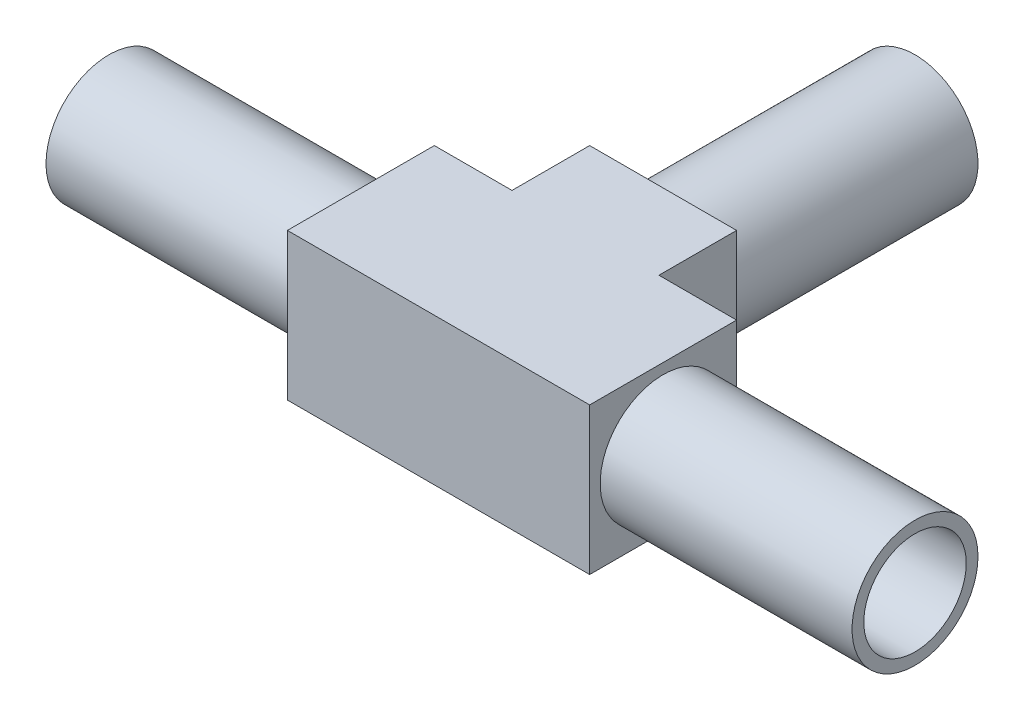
ISO-10303-21;
HEADER;
FILE_DESCRIPTION(('STEP AP214'),'2;1');
FILE_NAME('part.step','',(''),(''),'','','');
FILE_SCHEMA(('AUTOMOTIVE_DESIGN { 1 0 10303 214 1 1 1 1 }'));
ENDSEC;
DATA;
#1=APPLICATION_CONTEXT('core data for automotive mechanical design processes');
#2=APPLICATION_PROTOCOL_DEFINITION('international standard','automotive_design',2000,#1);
#3=PRODUCT_CONTEXT('',#1,'mechanical');
#4=PRODUCT('Part','Part','',(#3));
#5=PRODUCT_RELATED_PRODUCT_CATEGORY('part','',(#4));
#6=PRODUCT_DEFINITION_FORMATION('','',#4);
#7=PRODUCT_DEFINITION_CONTEXT('part definition',#1,'design');
#8=PRODUCT_DEFINITION('design','',#6,#7);
#9=PRODUCT_DEFINITION_SHAPE('','',#8);
#10=(LENGTH_UNIT() NAMED_UNIT(*) SI_UNIT(.MILLI.,.METRE.));
#11=(NAMED_UNIT(*) PLANE_ANGLE_UNIT() SI_UNIT($,.RADIAN.));
#12=(NAMED_UNIT(*) SI_UNIT($,.STERADIAN.) SOLID_ANGLE_UNIT());
#13=UNCERTAINTY_MEASURE_WITH_UNIT(LENGTH_MEASURE(1.E-05),#10,'distance_accuracy_value','');
#14=(GEOMETRIC_REPRESENTATION_CONTEXT(3) GLOBAL_UNCERTAINTY_ASSIGNED_CONTEXT((#13)) GLOBAL_UNIT_ASSIGNED_CONTEXT((#10,
#11,#12)) REPRESENTATION_CONTEXT('',''));
#15=CARTESIAN_POINT('',(0.,0.,0.));
#16=DIRECTION('',(0.,0.,1.));
#17=DIRECTION('',(1.,0.,0.));
#18=AXIS2_PLACEMENT_3D('',#15,#16,#17);
#19=CARTESIAN_POINT('',(24.92375,5.55625,0.));
#20=DIRECTION('',(-1.,0.,0.));
#21=DIRECTION('',(0.,0.,1.));
#22=AXIS2_PLACEMENT_3D('',#19,#20,#21);
#23=PLANE('',#22);
#24=DIRECTION('',(0.,1.,0.));
#25=VECTOR('',#24,1.);
#26=CARTESIAN_POINT('',(24.92375,5.55625,-5.55625));
#27=LINE('',#26,#25);
#28=CARTESIAN_POINT('',(24.92375,5.55625,-5.55625));
#29=VERTEX_POINT('',#28);
#30=CARTESIAN_POINT('',(24.92375,-5.55625000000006,-5.55625000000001));
#31=VERTEX_POINT('',#30);
#32=EDGE_CURVE('E154',#29,#31,#27,.F.);
#33=ORIENTED_EDGE('',*,*,#32,.F.);
#34=DIRECTION('',(0.,0.,1.));
#35=VECTOR('',#34,1.);
#36=CARTESIAN_POINT('',(24.92375,5.55625,5.55625));
#37=LINE('',#36,#35);
#38=CARTESIAN_POINT('',(24.92375,5.55625,-11.43));
#39=VERTEX_POINT('',#38);
#40=EDGE_CURVE('E144',#39,#29,#37,.T.);
#41=ORIENTED_EDGE('',*,*,#40,.F.);
#42=DIRECTION('',(0.,1.,0.));
#43=VECTOR('',#42,1.);
#44=CARTESIAN_POINT('',(24.92375,0.,-11.43));
#45=LINE('',#44,#43);
#46=CARTESIAN_POINT('',(24.92375,-5.55625000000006,-11.43));
#47=VERTEX_POINT('',#46);
#48=EDGE_CURVE('E158',#47,#39,#45,.T.);
#49=ORIENTED_EDGE('',*,*,#48,.F.);
#50=DIRECTION('',(0.,0.,1.));
#51=VECTOR('',#50,1.);
#52=CARTESIAN_POINT('',(24.92375,-5.55625000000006,-5.55625000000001));
#53=LINE('',#52,#51);
#54=EDGE_CURVE('E140',#31,#47,#53,.F.);
#55=ORIENTED_EDGE('',*,*,#54,.F.);
#56=EDGE_LOOP('',(#33,#41,#49,#55));
#57=FACE_BOUND('',#56,.T.);
#58=ADVANCED_FACE('F16',(#57),#23,.T.);
#59=CARTESIAN_POINT('',(36.03625,-5.55625,0.));
#60=DIRECTION('',(1.,0.,0.));
#61=DIRECTION('',(0.,0.,-1.));
#62=AXIS2_PLACEMENT_3D('',#59,#60,#61);
#63=PLANE('',#62);
#64=DIRECTION('',(0.,1.,0.));
#65=VECTOR('',#64,1.);
#66=CARTESIAN_POINT('',(36.03625,0.,-11.43));
#67=LINE('',#66,#65);
#68=CARTESIAN_POINT('',(36.03625,5.55625,-11.43));
#69=VERTEX_POINT('',#68);
#70=CARTESIAN_POINT('',(36.03625,-5.55625000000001,-11.43));
#71=VERTEX_POINT('',#70);
#72=EDGE_CURVE('E156',#69,#71,#67,.F.);
#73=ORIENTED_EDGE('',*,*,#72,.F.);
#74=DIRECTION('',(0.,0.,1.));
#75=VECTOR('',#74,1.);
#76=CARTESIAN_POINT('',(36.03625,5.55625,5.55625000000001));
#77=LINE('',#76,#75);
#78=CARTESIAN_POINT('',(36.03625,5.55625,-5.55624999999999));
#79=VERTEX_POINT('',#78);
#80=EDGE_CURVE('E150',#79,#69,#77,.F.);
#81=ORIENTED_EDGE('',*,*,#80,.F.);
#82=DIRECTION('',(0.,1.,0.));
#83=VECTOR('',#82,1.);
#84=CARTESIAN_POINT('',(36.03625,5.55625,-5.55624999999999));
#85=LINE('',#84,#83);
#86=CARTESIAN_POINT('',(36.03625,-5.55625000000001,-5.55625));
#87=VERTEX_POINT('',#86);
#88=EDGE_CURVE('E130',#87,#79,#85,.T.);
#89=ORIENTED_EDGE('',*,*,#88,.F.);
#90=DIRECTION('',(0.,0.,1.));
#91=VECTOR('',#90,1.);
#92=CARTESIAN_POINT('',(36.03625,-5.55625000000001,-5.55625));
#93=LINE('',#92,#91);
#94=EDGE_CURVE('E102',#71,#87,#93,.T.);
#95=ORIENTED_EDGE('',*,*,#94,.F.);
#96=EDGE_LOOP('',(#73,#81,#89,#95));
#97=FACE_BOUND('',#96,.T.);
#98=ADVANCED_FACE('F239',(#97),#63,.T.);
#99=CARTESIAN_POINT('',(33.258125,0.,-11.43));
#100=DIRECTION('',(0.,0.,-1.));
#101=DIRECTION('',(-1.,0.,0.));
#102=AXIS2_PLACEMENT_3D('',#99,#100,#101);
#103=PLANE('',#102);
#104=DIRECTION('',(1.,0.,0.));
#105=VECTOR('',#104,1.);
#106=CARTESIAN_POINT('',(19.05,5.55625,-11.43));
#107=LINE('',#106,#105);
#108=EDGE_CURVE('E147',#69,#39,#107,.F.);
#109=ORIENTED_EDGE('',*,*,#108,.F.);
#110=ORIENTED_EDGE('',*,*,#72,.T.);
#111=DIRECTION('',(1.,0.,0.));
#112=VECTOR('',#111,1.);
#113=CARTESIAN_POINT('',(19.05,-5.55625000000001,-11.43));
#114=LINE('',#113,#112);
#115=EDGE_CURVE('E138',#47,#71,#114,.T.);
#116=ORIENTED_EDGE('',*,*,#115,.F.);
#117=ORIENTED_EDGE('',*,*,#48,.T.);
#118=EDGE_LOOP('',(#109,#110,#116,#117));
#119=FACE_BOUND('',#118,.T.);
#120=CARTESIAN_POINT('',(30.48,0.,-11.43));
#121=DIRECTION('',(0.,0.,-1.));
#122=DIRECTION('',(-1.,0.,0.));
#123=AXIS2_PLACEMENT_3D('',#120,#121,#122);
#124=CIRCLE('',#123,4.7625);
#125=CARTESIAN_POINT('',(25.7175,0.,-11.43));
#126=VERTEX_POINT('',#125);
#127=EDGE_CURVE('E19',#126,#126,#124,.T.);
#128=ORIENTED_EDGE('',*,*,#127,.F.);
#129=EDGE_LOOP('',(#128));
#130=FACE_BOUND('',#129,.T.);
#131=ADVANCED_FACE('F236',(#119,#130),#103,.T.);
#132=CARTESIAN_POINT('',(19.05,5.55625,-5.55625));
#133=DIRECTION('',(0.,0.,-1.));
#134=DIRECTION('',(-1.,0.,0.));
#135=AXIS2_PLACEMENT_3D('',#132,#133,#134);
#136=PLANE('',#135);
#137=DIRECTION('',(0.,1.,0.));
#138=VECTOR('',#137,1.);
#139=CARTESIAN_POINT('',(19.05,0.,-5.55625));
#140=LINE('',#139,#138);
#141=CARTESIAN_POINT('',(19.05,5.55625,-5.55625));
#142=VERTEX_POINT('',#141);
#143=CARTESIAN_POINT('',(19.05,-5.55625,-5.55625));
#144=VERTEX_POINT('',#143);
#145=EDGE_CURVE('E117',#142,#144,#140,.F.);
#146=ORIENTED_EDGE('',*,*,#145,.F.);
#147=DIRECTION('',(1.,0.,0.));
#148=VECTOR('',#147,1.);
#149=CARTESIAN_POINT('',(19.05,5.55625,-5.55625));
#150=LINE('',#149,#148);
#151=EDGE_CURVE('E152',#29,#142,#150,.F.);
#152=ORIENTED_EDGE('',*,*,#151,.F.);
#153=ORIENTED_EDGE('',*,*,#32,.T.);
#154=DIRECTION('',(1.,0.,0.));
#155=VECTOR('',#154,1.);
#156=CARTESIAN_POINT('',(19.05,-5.55625,-5.55625));
#157=LINE('',#156,#155);
#158=EDGE_CURVE('E132',#144,#31,#157,.T.);
#159=ORIENTED_EDGE('',*,*,#158,.F.);
#160=EDGE_LOOP('',(#146,#152,#153,#159));
#161=FACE_BOUND('',#160,.T.);
#162=ADVANCED_FACE('F238',(#161),#136,.T.);
#163=CARTESIAN_POINT('',(19.05,5.55625000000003,5.55625));
#164=DIRECTION('',(0.,1.,0.));
#165=DIRECTION('',(0.,0.,1.));
#166=AXIS2_PLACEMENT_3D('',#163,#164,#165);
#167=PLANE('',#166);
#168=ORIENTED_EDGE('',*,*,#108,.T.);
#169=ORIENTED_EDGE('',*,*,#40,.T.);
#170=ORIENTED_EDGE('',*,*,#151,.T.);
#171=DIRECTION('',(0.,0.,1.));
#172=VECTOR('',#171,1.);
#173=CARTESIAN_POINT('',(19.05,5.55625,-2.778125));
#174=LINE('',#173,#172);
#175=CARTESIAN_POINT('',(19.05,5.55625,5.55625));
#176=VERTEX_POINT('',#175);
#177=EDGE_CURVE('E120',#176,#142,#174,.F.);
#178=ORIENTED_EDGE('',*,*,#177,.F.);
#179=DIRECTION('',(1.,0.,0.));
#180=VECTOR('',#179,1.);
#181=CARTESIAN_POINT('',(19.05,5.55625,5.55625));
#182=LINE('',#181,#180);
#183=CARTESIAN_POINT('',(41.91,5.55625000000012,5.55625));
#184=VERTEX_POINT('',#183);
#185=EDGE_CURVE('E142',#184,#176,#182,.F.);
#186=ORIENTED_EDGE('',*,*,#185,.F.);
#187=DIRECTION('',(0.,0.,1.));
#188=VECTOR('',#187,1.);
#189=CARTESIAN_POINT('',(41.91,5.55625000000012,-2.778125));
#190=LINE('',#189,#188);
#191=CARTESIAN_POINT('',(41.91,5.55625000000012,-5.55625));
#192=VERTEX_POINT('',#191);
#193=EDGE_CURVE('E115',#192,#184,#190,.T.);
#194=ORIENTED_EDGE('',*,*,#193,.F.);
#195=DIRECTION('',(-1.,0.,0.));
#196=VECTOR('',#195,1.);
#197=CARTESIAN_POINT('',(19.05,5.55625,-5.55625));
#198=LINE('',#197,#196);
#199=EDGE_CURVE('E105',#79,#192,#198,.F.);
#200=ORIENTED_EDGE('',*,*,#199,.F.);
#201=ORIENTED_EDGE('',*,*,#80,.T.);
#202=EDGE_LOOP('',(#168,#169,#170,#178,#186,#194,#200,#201));
#203=FACE_BOUND('',#202,.T.);
#204=ADVANCED_FACE('F246',(#203),#167,.T.);
#205=CARTESIAN_POINT('',(19.05,-5.55625,5.55625));
#206=DIRECTION('',(0.,0.,1.));
#207=DIRECTION('',(0.,-1.,0.));
#208=AXIS2_PLACEMENT_3D('',#205,#206,#207);
#209=PLANE('',#208);
#210=DIRECTION('',(0.,1.,0.));
#211=VECTOR('',#210,1.);
#212=CARTESIAN_POINT('',(41.91,1.2490009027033E-13,5.55625));
#213=LINE('',#212,#211);
#214=CARTESIAN_POINT('',(41.91,-5.55625000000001,5.55625));
#215=VERTEX_POINT('',#214);
#216=EDGE_CURVE('E92',#184,#215,#213,.F.);
#217=ORIENTED_EDGE('',*,*,#216,.F.);
#218=ORIENTED_EDGE('',*,*,#185,.T.);
#219=DIRECTION('',(0.,1.,0.));
#220=VECTOR('',#219,1.);
#221=CARTESIAN_POINT('',(19.05,0.,5.55625));
#222=LINE('',#221,#220);
#223=CARTESIAN_POINT('',(19.05,-5.55625,5.55625));
#224=VERTEX_POINT('',#223);
#225=EDGE_CURVE('E123',#224,#176,#222,.T.);
#226=ORIENTED_EDGE('',*,*,#225,.F.);
#227=DIRECTION('',(1.,0.,0.));
#228=VECTOR('',#227,1.);
#229=CARTESIAN_POINT('',(19.05,-5.55625,5.55625));
#230=LINE('',#229,#228);
#231=EDGE_CURVE('E135',#215,#224,#230,.F.);
#232=ORIENTED_EDGE('',*,*,#231,.F.);
#233=EDGE_LOOP('',(#217,#218,#226,#232));
#234=FACE_BOUND('',#233,.T.);
#235=ADVANCED_FACE('F254',(#234),#209,.T.);
#236=CARTESIAN_POINT('',(19.05,-5.55625,-5.55625));
#237=DIRECTION('',(0.,-1.,0.));
#238=DIRECTION('',(1.,0.,0.));
#239=AXIS2_PLACEMENT_3D('',#236,#237,#238);
#240=PLANE('',#239);
#241=DIRECTION('',(0.,0.,1.));
#242=VECTOR('',#241,1.);
#243=CARTESIAN_POINT('',(19.05,-5.55625,-2.778125));
#244=LINE('',#243,#242);
#245=EDGE_CURVE('E126',#144,#224,#244,.T.);
#246=ORIENTED_EDGE('',*,*,#245,.F.);
#247=ORIENTED_EDGE('',*,*,#158,.T.);
#248=ORIENTED_EDGE('',*,*,#54,.T.);
#249=ORIENTED_EDGE('',*,*,#115,.T.);
#250=ORIENTED_EDGE('',*,*,#94,.T.);
#251=DIRECTION('',(-1.,0.,0.));
#252=VECTOR('',#251,1.);
#253=CARTESIAN_POINT('',(19.05,-5.55625000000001,-5.55625));
#254=LINE('',#253,#252);
#255=CARTESIAN_POINT('',(41.91,-5.55625000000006,-5.55625));
#256=VERTEX_POINT('',#255);
#257=EDGE_CURVE('E97',#256,#87,#254,.T.);
#258=ORIENTED_EDGE('',*,*,#257,.F.);
#259=DIRECTION('',(0.,0.,1.));
#260=VECTOR('',#259,1.);
#261=CARTESIAN_POINT('',(41.91,-5.55625000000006,-2.778125));
#262=LINE('',#261,#260);
#263=EDGE_CURVE('E84',#215,#256,#262,.F.);
#264=ORIENTED_EDGE('',*,*,#263,.F.);
#265=ORIENTED_EDGE('',*,*,#231,.T.);
#266=EDGE_LOOP('',(#246,#247,#248,#249,#250,#258,#264,#265));
#267=FACE_BOUND('',#266,.T.);
#268=ADVANCED_FACE('F99',(#267),#240,.T.);
#269=CARTESIAN_POINT('',(19.05,5.55625,-5.55625));
#270=DIRECTION('',(0.,0.,-1.));
#271=DIRECTION('',(-1.,0.,0.));
#272=AXIS2_PLACEMENT_3D('',#269,#270,#271);
#273=PLANE('',#272);
#274=DIRECTION('',(0.,1.,0.));
#275=VECTOR('',#274,1.);
#276=CARTESIAN_POINT('',(41.91,1.2490009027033E-13,-5.55625));
#277=LINE('',#276,#275);
#278=EDGE_CURVE('E89',#256,#192,#277,.T.);
#279=ORIENTED_EDGE('',*,*,#278,.F.);
#280=ORIENTED_EDGE('',*,*,#257,.T.);
#281=ORIENTED_EDGE('',*,*,#88,.T.);
#282=ORIENTED_EDGE('',*,*,#199,.T.);
#283=EDGE_LOOP('',(#279,#280,#281,#282));
#284=FACE_BOUND('',#283,.T.);
#285=ADVANCED_FACE('F107',(#284),#273,.T.);
#286=CARTESIAN_POINT('',(30.48,0.,-20.955));
#287=DIRECTION('',(0.,0.,-1.));
#288=DIRECTION('',(-1.,0.,0.));
#289=AXIS2_PLACEMENT_3D('',#286,#287,#288);
#290=CYLINDRICAL_SURFACE('',#289,4.7625);
#291=CARTESIAN_POINT('',(30.48,0.,-30.48));
#292=DIRECTION('',(0.,0.,-1.));
#293=DIRECTION('',(-1.,0.,0.));
#294=AXIS2_PLACEMENT_3D('',#291,#292,#293);
#295=CIRCLE('',#294,4.7625);
#296=CARTESIAN_POINT('',(25.7175,0.,-30.48));
#297=VERTEX_POINT('',#296);
#298=EDGE_CURVE('E109',#297,#297,#295,.T.);
#299=ORIENTED_EDGE('',*,*,#298,.F.);
#300=EDGE_LOOP('',(#299));
#301=FACE_BOUND('',#300,.T.);
#302=ORIENTED_EDGE('',*,*,#127,.T.);
#303=EDGE_LOOP('',(#302));
#304=FACE_BOUND('',#303,.T.);
#305=ADVANCED_FACE('F184',(#301,#304),#290,.T.);
#306=CARTESIAN_POINT('',(19.05,0.,-2.778125));
#307=DIRECTION('',(-1.,0.,0.));
#308=DIRECTION('',(0.,0.,1.));
#309=AXIS2_PLACEMENT_3D('',#306,#307,#308);
#310=PLANE('',#309);
#311=ORIENTED_EDGE('',*,*,#177,.T.);
#312=ORIENTED_EDGE('',*,*,#145,.T.);
#313=ORIENTED_EDGE('',*,*,#245,.T.);
#314=ORIENTED_EDGE('',*,*,#225,.T.);
#315=EDGE_LOOP('',(#311,#312,#313,#314));
#316=FACE_BOUND('',#315,.T.);
#317=CARTESIAN_POINT('',(19.05,0.,0.));
#318=DIRECTION('',(-1.,0.,0.));
#319=DIRECTION('',(0.,0.,1.));
#320=AXIS2_PLACEMENT_3D('',#317,#318,#319);
#321=CIRCLE('',#320,4.7625);
#322=CARTESIAN_POINT('',(19.05,0.,4.7625));
#323=VERTEX_POINT('',#322);
#324=EDGE_CURVE('E112',#323,#323,#321,.T.);
#325=ORIENTED_EDGE('',*,*,#324,.F.);
#326=EDGE_LOOP('',(#325));
#327=FACE_BOUND('',#326,.T.);
#328=ADVANCED_FACE('F182',(#316,#327),#310,.T.);
#329=CARTESIAN_POINT('',(41.91,1.2490009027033E-13,-2.778125));
#330=DIRECTION('',(1.,0.,0.));
#331=DIRECTION('',(0.,1.,0.));
#332=AXIS2_PLACEMENT_3D('',#329,#330,#331);
#333=PLANE('',#332);
#334=ORIENTED_EDGE('',*,*,#263,.T.);
#335=ORIENTED_EDGE('',*,*,#278,.T.);
#336=ORIENTED_EDGE('',*,*,#193,.T.);
#337=ORIENTED_EDGE('',*,*,#216,.T.);
#338=EDGE_LOOP('',(#334,#335,#336,#337));
#339=FACE_BOUND('',#338,.T.);
#340=CARTESIAN_POINT('',(41.91,1.2490009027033E-13,0.));
#341=DIRECTION('',(1.,0.,0.));
#342=DIRECTION('',(0.,0.,-1.));
#343=AXIS2_PLACEMENT_3D('',#340,#341,#342);
#344=CIRCLE('',#343,4.7625);
#345=CARTESIAN_POINT('',(41.91,1.2490009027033E-13,-4.7625));
#346=VERTEX_POINT('',#345);
#347=EDGE_CURVE('E174',#346,#346,#344,.T.);
#348=ORIENTED_EDGE('',*,*,#347,.F.);
#349=EDGE_LOOP('',(#348));
#350=FACE_BOUND('',#349,.T.);
#351=ADVANCED_FACE('F86',(#339,#350),#333,.T.);
#352=CARTESIAN_POINT('',(32.86125,0.,-30.48));
#353=DIRECTION('',(0.,0.,-1.));
#354=DIRECTION('',(-1.,0.,0.));
#355=AXIS2_PLACEMENT_3D('',#352,#353,#354);
#356=PLANE('',#355);
#357=ORIENTED_EDGE('',*,*,#298,.T.);
#358=EDGE_LOOP('',(#357));
#359=FACE_BOUND('',#358,.T.);
#360=CARTESIAN_POINT('',(30.48,0.,-30.48));
#361=DIRECTION('',(0.,0.,1.));
#362=DIRECTION('',(1.,0.,0.));
#363=AXIS2_PLACEMENT_3D('',#360,#361,#362);
#364=CIRCLE('',#363,3.8735);
#365=CARTESIAN_POINT('',(34.3535,0.,-30.48));
#366=VERTEX_POINT('',#365);
#367=EDGE_CURVE('E171',#366,#366,#364,.T.);
#368=ORIENTED_EDGE('',*,*,#367,.T.);
#369=EDGE_LOOP('',(#368));
#370=FACE_BOUND('',#369,.T.);
#371=ADVANCED_FACE('F192',(#359,#370),#356,.T.);
#372=CARTESIAN_POINT('',(9.52500000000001,1.2490009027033E-13,0.));
#373=DIRECTION('',(-1.,0.,0.));
#374=DIRECTION('',(0.,0.,1.));
#375=AXIS2_PLACEMENT_3D('',#372,#373,#374);
#376=CYLINDRICAL_SURFACE('',#375,4.7625);
#377=CARTESIAN_POINT('',(0.,0.,0.));
#378=DIRECTION('',(-1.,0.,0.));
#379=DIRECTION('',(0.,0.,1.));
#380=AXIS2_PLACEMENT_3D('',#377,#378,#379);
#381=CIRCLE('',#380,4.7625);
#382=CARTESIAN_POINT('',(0.,0.,4.7625));
#383=VERTEX_POINT('',#382);
#384=EDGE_CURVE('E168',#383,#383,#381,.T.);
#385=ORIENTED_EDGE('',*,*,#384,.F.);
#386=EDGE_LOOP('',(#385));
#387=FACE_BOUND('',#386,.T.);
#388=ORIENTED_EDGE('',*,*,#324,.T.);
#389=EDGE_LOOP('',(#388));
#390=FACE_BOUND('',#389,.T.);
#391=ADVANCED_FACE('F180',(#387,#390),#376,.T.);
#392=CARTESIAN_POINT('',(51.435,0.,0.));
#393=DIRECTION('',(1.,0.,0.));
#394=DIRECTION('',(0.,0.,-1.));
#395=AXIS2_PLACEMENT_3D('',#392,#393,#394);
#396=CYLINDRICAL_SURFACE('',#395,4.7625);
#397=CARTESIAN_POINT('',(60.96,0.,0.));
#398=DIRECTION('',(1.,0.,0.));
#399=DIRECTION('',(0.,0.,-1.));
#400=AXIS2_PLACEMENT_3D('',#397,#398,#399);
#401=CIRCLE('',#400,4.7625);
#402=CARTESIAN_POINT('',(60.96,0.,-4.7625));
#403=VERTEX_POINT('',#402);
#404=EDGE_CURVE('E165',#403,#403,#401,.T.);
#405=ORIENTED_EDGE('',*,*,#404,.F.);
#406=EDGE_LOOP('',(#405));
#407=FACE_BOUND('',#406,.T.);
#408=ORIENTED_EDGE('',*,*,#347,.T.);
#409=EDGE_LOOP('',(#408));
#410=FACE_BOUND('',#409,.T.);
#411=ADVANCED_FACE('F216',(#407,#410),#396,.T.);
#412=CARTESIAN_POINT('',(30.48,0.,-15.24));
#413=DIRECTION('',(0.,0.,1.));
#414=DIRECTION('',(1.,0.,0.));
#415=AXIS2_PLACEMENT_3D('',#412,#413,#414);
#416=CYLINDRICAL_SURFACE('',#415,3.8735);
#417=CARTESIAN_POINT('',(30.48,0.,0.));
#418=DIRECTION('',(-0.707106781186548,0.,0.707106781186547));
#419=DIRECTION('',(0.707106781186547,0.,0.707106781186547));
#420=AXIS2_PLACEMENT_3D('',#417,#418,#419);
#421=ELLIPSE('',#420,5.47795623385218,3.8735);
#422=CARTESIAN_POINT('',(30.48,3.8735,0.));
#423=VERTEX_POINT('',#422);
#424=CARTESIAN_POINT('',(30.48,-3.87350000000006,0.));
#425=VERTEX_POINT('',#424);
#426=EDGE_CURVE('E31',#423,#425,#421,.T.);
#427=ORIENTED_EDGE('',*,*,#426,.T.);
#428=CARTESIAN_POINT('',(30.48,0.,0.));
#429=DIRECTION('',(0.707106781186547,0.,0.707106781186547));
#430=DIRECTION('',(-0.707106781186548,0.,0.707106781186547));
#431=AXIS2_PLACEMENT_3D('',#428,#429,#430);
#432=ELLIPSE('',#431,5.47795623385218,3.8735);
#433=EDGE_CURVE('E163',#425,#423,#432,.T.);
#434=ORIENTED_EDGE('',*,*,#433,.T.);
#435=EDGE_LOOP('',(#427,#434));
#436=FACE_BOUND('',#435,.T.);
#437=ORIENTED_EDGE('',*,*,#367,.F.);
#438=EDGE_LOOP('',(#437));
#439=FACE_BOUND('',#438,.T.);
#440=ADVANCED_FACE('F212',(#436,#439),#416,.F.);
#441=CARTESIAN_POINT('',(0.,0.,-2.38125));
#442=DIRECTION('',(-1.,0.,0.));
#443=DIRECTION('',(0.,0.,1.));
#444=AXIS2_PLACEMENT_3D('',#441,#442,#443);
#445=PLANE('',#444);
#446=ORIENTED_EDGE('',*,*,#384,.T.);
#447=EDGE_LOOP('',(#446));
#448=FACE_BOUND('',#447,.T.);
#449=CARTESIAN_POINT('',(0.,0.,0.));
#450=DIRECTION('',(1.,0.,0.));
#451=DIRECTION('',(0.,0.,-1.));
#452=AXIS2_PLACEMENT_3D('',#449,#450,#451);
#453=CIRCLE('',#452,3.8735);
#454=CARTESIAN_POINT('',(0.,0.,-3.8735));
#455=VERTEX_POINT('',#454);
#456=EDGE_CURVE('E25',#455,#455,#453,.T.);
#457=ORIENTED_EDGE('',*,*,#456,.T.);
#458=EDGE_LOOP('',(#457));
#459=FACE_BOUND('',#458,.T.);
#460=ADVANCED_FACE('F204',(#448,#459),#445,.T.);
#461=CARTESIAN_POINT('',(60.96,0.,2.38125));
#462=DIRECTION('',(1.,0.,0.));
#463=DIRECTION('',(0.,0.,-1.));
#464=AXIS2_PLACEMENT_3D('',#461,#462,#463);
#465=PLANE('',#464);
#466=ORIENTED_EDGE('',*,*,#404,.T.);
#467=EDGE_LOOP('',(#466));
#468=FACE_BOUND('',#467,.T.);
#469=CARTESIAN_POINT('',(60.96,0.,0.));
#470=DIRECTION('',(1.,0.,0.));
#471=DIRECTION('',(0.,0.,-1.));
#472=AXIS2_PLACEMENT_3D('',#469,#470,#471);
#473=CIRCLE('',#472,3.8735);
#474=CARTESIAN_POINT('',(60.96,0.,-3.8735));
#475=VERTEX_POINT('',#474);
#476=EDGE_CURVE('E11',#475,#475,#473,.F.);
#477=ORIENTED_EDGE('',*,*,#476,.T.);
#478=EDGE_LOOP('',(#477));
#479=FACE_BOUND('',#478,.T.);
#480=ADVANCED_FACE('F198',(#468,#479),#465,.T.);
#481=CARTESIAN_POINT('',(30.48,0.,0.));
#482=DIRECTION('',(1.,0.,0.));
#483=DIRECTION('',(0.,0.,-1.));
#484=AXIS2_PLACEMENT_3D('',#481,#482,#483);
#485=CYLINDRICAL_SURFACE('',#484,3.8735);
#486=ORIENTED_EDGE('',*,*,#456,.F.);
#487=EDGE_LOOP('',(#486));
#488=FACE_BOUND('',#487,.T.);
#489=ORIENTED_EDGE('',*,*,#476,.F.);
#490=EDGE_LOOP('',(#489));
#491=FACE_BOUND('',#490,.T.);
#492=ORIENTED_EDGE('',*,*,#433,.F.);
#493=ORIENTED_EDGE('',*,*,#426,.F.);
#494=EDGE_LOOP('',(#492,#493));
#495=FACE_BOUND('',#494,.T.);
#496=ADVANCED_FACE('F196',(#488,#491,#495),#485,.F.);
#497=CLOSED_SHELL('',(#58,#98,#131,#162,#204,#235,#268,#285,#305,#328,#351,#371,#391,#411,#440,
#460,#480,#496));
#498=MANIFOLD_SOLID_BREP('B1',#497);
#499=ADVANCED_BREP_SHAPE_REPRESENTATION('',(#18,#498),#14);
#500=SHAPE_DEFINITION_REPRESENTATION(#9,#499);
ENDSEC;
END-ISO-10303-21;
